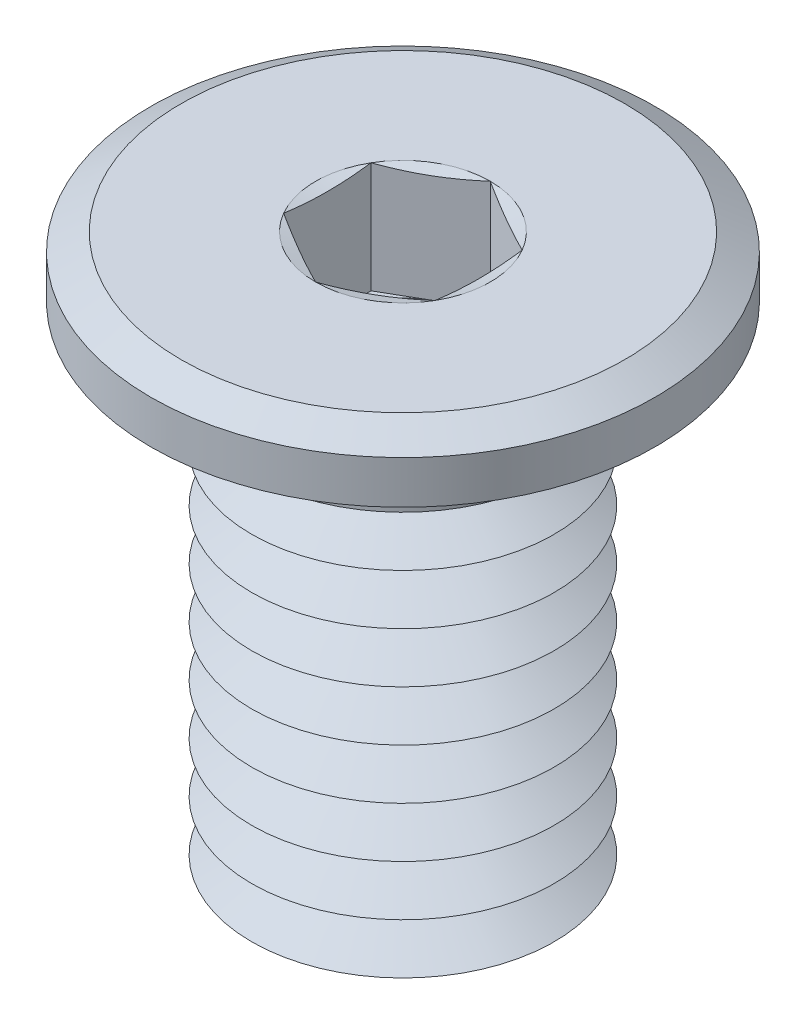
from build123d import *

# Parameters (mm, degrees)
SKETCH1_R           = 5
BOSS_EXTRUDE1_DEPTH = 1.2
SKETCH2_R           = 3
BOSS_EXTRUDE2_DEPTH = 10
LPATTERN1_COUNT     = 9
LPATTERN1_PITCH     = 1
FILLET1_R           = 0.25
CHAMFER2_SIZE       = 0.6
CHAMFER2_SIZE2      = 0.346410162
CUT_EXTRUDE1_DEPTH  = 2.2


with BuildPart() as part:
    # Sketch1 → Boss-Extrude1 (new body)
    with BuildSketch(Plane(origin=(0, 0, 0), x_dir=(1, 0, 0), z_dir=(0, 1, 0))):
        with Locations(Location((0, 0, 0), (0, 0, 270))):
            Circle(SKETCH1_R)
    extrude(amount=-BOSS_EXTRUDE1_DEPTH)

    # Sketch2 → Boss-Extrude2 (add)
    with BuildSketch(Plane.XZ.offset(1.2)):
        with Locations(Location((0, 0, 0), (0, 0, 270))):
            Circle(SKETCH2_R)
    extrude(amount=BOSS_EXTRUDE2_DEPTH)

    # Sketch5 → Cut-Revolve1 (revolve, cut)
    with BuildSketch(Plane(origin=(0, 0, 0), x_dir=(0, 0, -1), z_dir=(1, 0, 0))):
        Polygon((-3, -11.7), (-2.133974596, -11.2), (-3, -10.7), align=None)
    cut_revolve1 = revolve(axis=Axis((0, 0.990593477, 0), (0, -1, 0)), mode=Mode.SUBTRACT)

    # LPattern1: Cut-Revolve1 ×9
    with Locations(*[(0, i * LPATTERN1_PITCH, 0) for i in range(1, LPATTERN1_COUNT)]):
        add(cut_revolve1, mode=Mode.SUBTRACT)

    # Fillet1
    fillet1_edges = [part.edges().sort_by_distance(p)[0] for p in [
        (0, -1.2, 3),
    ]]
    fillet(fillet1_edges, radius=FILLET1_R)

    # Chamfer2
    chamfer2_edges = [part.edges().sort_by_distance(p)[0] for p in [
        (0, 0, -5),
    ]]
    chamfer2_side = [part.faces().sort_by_distance(p)[0] for p in [
        (0, 0, 0),
    ]]
    chamfer(chamfer2_edges, length=CHAMFER2_SIZE, length2=CHAMFER2_SIZE2, reference=chamfer2_side[0])

    # Sketch6 → Cut-Extrude1 (cut)
    with BuildSketch(Plane(origin=(0, 0, 0), x_dir=(1, 0, 0), z_dir=(0, 1, 0))):
        Polygon((0, 1.732050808), (-1.5, 0.866025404), (-1.5, -0.866025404), (0, -1.732050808), (1.5, -0.866025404), (1.5, 0.866025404), align=None)
    extrude(amount=-CUT_EXTRUDE1_DEPTH, mode=Mode.SUBTRACT)

    # Cut-Extrude2 cone 1 section (on through the dimple's axis) → Cut-Extrude2 (revolve, cut)
    with BuildSketch(Plane(origin=(0, -2.2, 0), x_dir=(0, 0, 1), z_dir=(1, 0, 0))):
        Polygon((0, 0), (1.5, 0), (0, 0.866025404), align=None)
    revolve(axis=Axis((0, -2.2, 0), (0, -1, 0)), mode=Mode.SUBTRACT)

    # Cut-Extrude3 cone 1 section (on through the dimple's axis) → Cut-Extrude3 (revolve, cut)
    with BuildSketch(Plane(origin=(0, 0, 0), x_dir=(0, 0, 1), z_dir=(1, 0, 0))):
        Polygon((0, 0), (1.732050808, 0), (0, 0.464101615), align=None)
    revolve(axis=Axis((0, 0, 0), (0, -1, 0)), mode=Mode.SUBTRACT)


solid = part.part
